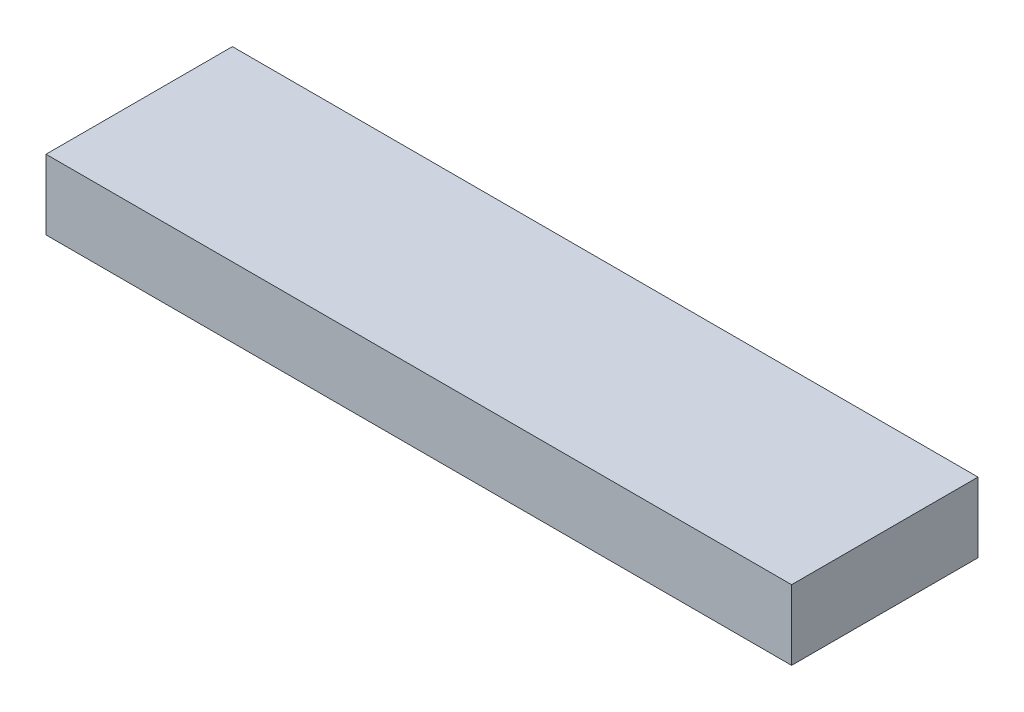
from build123d import *

# Parameters (mm, degrees)
SKETCH_1_W      = 40
SKETCH_1_H      = 15
EXTRUDE_1_DEPTH = 160


with BuildPart() as part:
    # Sketch 1 → Extrude 1 (new body)
    with BuildSketch(Plane(origin=(0, 0, 0), x_dir=(0, 0, -1), z_dir=(1, 0, 0))):
        with Locations((0, 7.5)):
            Rectangle(SKETCH_1_W, SKETCH_1_H)
    extrude(amount=EXTRUDE_1_DEPTH)


solid = part.part
